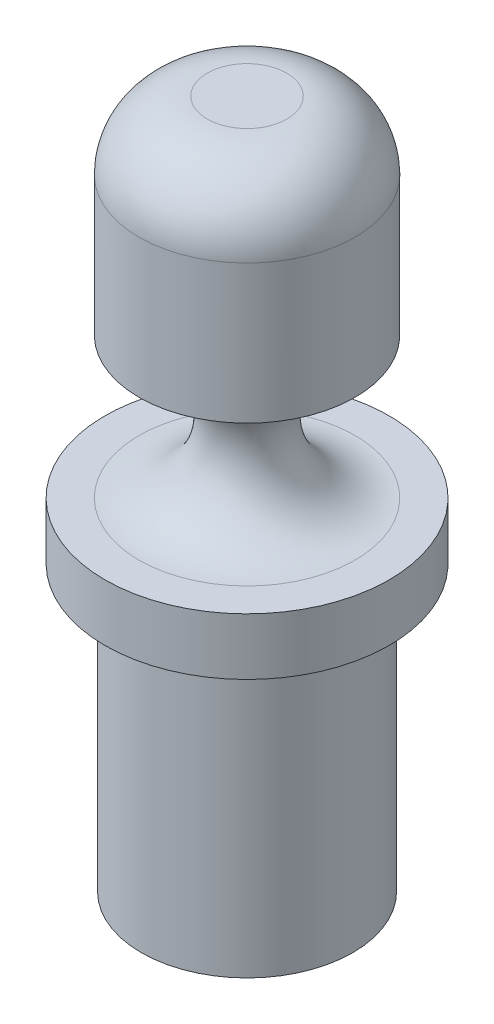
ISO-10303-21;
HEADER;
FILE_DESCRIPTION(('STEP AP214'),'2;1');
FILE_NAME('part.step','',(''),(''),'','','');
FILE_SCHEMA(('AUTOMOTIVE_DESIGN { 1 0 10303 214 1 1 1 1 }'));
ENDSEC;
DATA;
#1=APPLICATION_CONTEXT('core data for automotive mechanical design processes');
#2=APPLICATION_PROTOCOL_DEFINITION('international standard','automotive_design',2000,#1);
#3=PRODUCT_CONTEXT('',#1,'mechanical');
#4=PRODUCT('Part','Part','',(#3));
#5=PRODUCT_RELATED_PRODUCT_CATEGORY('part','',(#4));
#6=PRODUCT_DEFINITION_FORMATION('','',#4);
#7=PRODUCT_DEFINITION_CONTEXT('part definition',#1,'design');
#8=PRODUCT_DEFINITION('design','',#6,#7);
#9=PRODUCT_DEFINITION_SHAPE('','',#8);
#10=(LENGTH_UNIT() NAMED_UNIT(*) SI_UNIT(.MILLI.,.METRE.));
#11=(NAMED_UNIT(*) PLANE_ANGLE_UNIT() SI_UNIT($,.RADIAN.));
#12=(NAMED_UNIT(*) SI_UNIT($,.STERADIAN.) SOLID_ANGLE_UNIT());
#13=UNCERTAINTY_MEASURE_WITH_UNIT(LENGTH_MEASURE(1.E-05),#10,'distance_accuracy_value','');
#14=(GEOMETRIC_REPRESENTATION_CONTEXT(3) GLOBAL_UNCERTAINTY_ASSIGNED_CONTEXT((#13)) GLOBAL_UNIT_ASSIGNED_CONTEXT((#10,
#11,#12)) REPRESENTATION_CONTEXT('',''));
#15=CARTESIAN_POINT('',(0.,0.,0.));
#16=DIRECTION('',(0.,0.,1.));
#17=DIRECTION('',(1.,0.,0.));
#18=AXIS2_PLACEMENT_3D('',#15,#16,#17);
#19=CARTESIAN_POINT('',(0.,13.8684,0.));
#20=DIRECTION('',(0.,-1.,0.));
#21=DIRECTION('',(0.,0.,-1.));
#22=AXIS2_PLACEMENT_3D('',#19,#20,#21);
#23=DEGENERATE_TOROIDAL_SURFACE('',#22,0.888999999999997,1.524,.T.);
#24=CARTESIAN_POINT('',(0.,15.3924,0.));
#25=DIRECTION('',(0.,-1.,0.));
#26=DIRECTION('',(0.,0.,-1.));
#27=AXIS2_PLACEMENT_3D('',#24,#25,#26);
#28=CIRCLE('',#27,0.888999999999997);
#29=CARTESIAN_POINT('',(0.,15.3924,-0.888999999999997));
#30=VERTEX_POINT('',#29);
#31=EDGE_CURVE('E43',#30,#30,#28,.F.);
#32=ORIENTED_EDGE('',*,*,#31,.F.);
#33=EDGE_LOOP('',(#32));
#34=FACE_BOUND('',#33,.T.);
#35=CARTESIAN_POINT('',(0.,13.8684,0.));
#36=DIRECTION('',(0.,-1.,0.));
#37=DIRECTION('',(0.,0.,-1.));
#38=AXIS2_PLACEMENT_3D('',#35,#36,#37);
#39=CIRCLE('',#38,2.413);
#40=CARTESIAN_POINT('',(0.,13.8684,-2.413));
#41=VERTEX_POINT('',#40);
#42=EDGE_CURVE('E10',#41,#41,#39,.T.);
#43=ORIENTED_EDGE('',*,*,#42,.F.);
#44=EDGE_LOOP('',(#43));
#45=FACE_BOUND('',#44,.T.);
#46=ADVANCED_FACE('F37',(#34,#45),#23,.T.);
#47=CARTESIAN_POINT('',(2.413,15.3924,0.));
#48=DIRECTION('',(0.,-1.,0.));
#49=DIRECTION('',(0.,0.,-1.));
#50=AXIS2_PLACEMENT_3D('',#47,#48,#49);
#51=PLANE('',#50);
#52=ORIENTED_EDGE('',*,*,#31,.T.);
#53=EDGE_LOOP('',(#52));
#54=FACE_BOUND('',#53,.T.);
#55=ADVANCED_FACE('F81',(#54),#51,.F.);
#56=CARTESIAN_POINT('',(0.,63.2806748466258,0.));
#57=DIRECTION('',(0.,1.,0.));
#58=DIRECTION('',(0.,0.,1.));
#59=AXIS2_PLACEMENT_3D('',#56,#57,#58);
#60=CYLINDRICAL_SURFACE('',#59,2.413);
#61=ORIENTED_EDGE('',*,*,#42,.T.);
#62=EDGE_LOOP('',(#61));
#63=FACE_BOUND('',#62,.T.);
#64=CARTESIAN_POINT('',(0.,10.7696,0.));
#65=DIRECTION('',(0.,1.,0.));
#66=DIRECTION('',(0.,0.,1.));
#67=AXIS2_PLACEMENT_3D('',#64,#65,#66);
#68=CIRCLE('',#67,2.413);
#69=CARTESIAN_POINT('',(0.,10.7696,2.413));
#70=VERTEX_POINT('',#69);
#71=EDGE_CURVE('E47',#70,#70,#68,.T.);
#72=ORIENTED_EDGE('',*,*,#71,.T.);
#73=EDGE_LOOP('',(#72));
#74=FACE_BOUND('',#73,.T.);
#75=ADVANCED_FACE('F86',(#63,#74),#60,.T.);
#76=CARTESIAN_POINT('',(0.,9.1948,0.));
#77=DIRECTION('',(0.,1.,0.));
#78=DIRECTION('',(0.,0.,1.));
#79=AXIS2_PLACEMENT_3D('',#76,#77,#78);
#80=TOROIDAL_SURFACE('',#79,2.413,1.5748);
#81=ORIENTED_EDGE('',*,*,#71,.F.);
#82=EDGE_LOOP('',(#81));
#83=FACE_BOUND('',#82,.T.);
#84=CARTESIAN_POINT('',(0.,7.62,0.));
#85=DIRECTION('',(0.,1.,0.));
#86=DIRECTION('',(0.,0.,1.));
#87=AXIS2_PLACEMENT_3D('',#84,#85,#86);
#88=CIRCLE('',#87,2.413);
#89=CARTESIAN_POINT('',(0.,7.62,2.413));
#90=VERTEX_POINT('',#89);
#91=EDGE_CURVE('E51',#90,#90,#88,.T.);
#92=ORIENTED_EDGE('',*,*,#91,.T.);
#93=EDGE_LOOP('',(#92));
#94=FACE_BOUND('',#93,.T.);
#95=ADVANCED_FACE('F91',(#83,#94),#80,.F.);
#96=CARTESIAN_POINT('',(3.17500000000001,7.62,0.));
#97=DIRECTION('',(0.,-1.,0.));
#98=DIRECTION('',(0.,0.,-1.));
#99=AXIS2_PLACEMENT_3D('',#96,#97,#98);
#100=PLANE('',#99);
#101=ORIENTED_EDGE('',*,*,#91,.F.);
#102=EDGE_LOOP('',(#101));
#103=FACE_BOUND('',#102,.T.);
#104=CARTESIAN_POINT('',(0.,7.62,0.));
#105=DIRECTION('',(0.,1.,0.));
#106=DIRECTION('',(0.,0.,1.));
#107=AXIS2_PLACEMENT_3D('',#104,#105,#106);
#108=CIRCLE('',#107,3.17500000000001);
#109=CARTESIAN_POINT('',(0.,7.62,3.17500000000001));
#110=VERTEX_POINT('',#109);
#111=EDGE_CURVE('E56',#110,#110,#108,.T.);
#112=ORIENTED_EDGE('',*,*,#111,.T.);
#113=EDGE_LOOP('',(#112));
#114=FACE_BOUND('',#113,.T.);
#115=ADVANCED_FACE('F96',(#103,#114),#100,.F.);
#116=CARTESIAN_POINT('',(0.,63.2806748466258,0.));
#117=DIRECTION('',(0.,1.,0.));
#118=DIRECTION('',(0.,0.,1.));
#119=AXIS2_PLACEMENT_3D('',#116,#117,#118);
#120=CYLINDRICAL_SURFACE('',#119,3.17500000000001);
#121=ORIENTED_EDGE('',*,*,#111,.F.);
#122=EDGE_LOOP('',(#121));
#123=FACE_BOUND('',#122,.T.);
#124=CARTESIAN_POINT('',(0.,6.35,0.));
#125=DIRECTION('',(0.,1.,0.));
#126=DIRECTION('',(0.,0.,1.));
#127=AXIS2_PLACEMENT_3D('',#124,#125,#126);
#128=CIRCLE('',#127,3.17500000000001);
#129=CARTESIAN_POINT('',(0.,6.35,3.17500000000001));
#130=VERTEX_POINT('',#129);
#131=EDGE_CURVE('E59',#130,#130,#128,.T.);
#132=ORIENTED_EDGE('',*,*,#131,.T.);
#133=EDGE_LOOP('',(#132));
#134=FACE_BOUND('',#133,.T.);
#135=ADVANCED_FACE('F100',(#123,#134),#120,.T.);
#136=CARTESIAN_POINT('',(2.3622,6.35,0.));
#137=DIRECTION('',(0.,1.,0.));
#138=DIRECTION('',(0.,0.,1.));
#139=AXIS2_PLACEMENT_3D('',#136,#137,#138);
#140=PLANE('',#139);
#141=ORIENTED_EDGE('',*,*,#131,.F.);
#142=EDGE_LOOP('',(#141));
#143=FACE_BOUND('',#142,.T.);
#144=CARTESIAN_POINT('',(0.,6.35,0.));
#145=DIRECTION('',(0.,1.,0.));
#146=DIRECTION('',(0.,0.,1.));
#147=AXIS2_PLACEMENT_3D('',#144,#145,#146);
#148=CIRCLE('',#147,2.3622);
#149=CARTESIAN_POINT('',(0.,6.35,2.3622));
#150=VERTEX_POINT('',#149);
#151=EDGE_CURVE('E62',#150,#150,#148,.T.);
#152=ORIENTED_EDGE('',*,*,#151,.T.);
#153=EDGE_LOOP('',(#152));
#154=FACE_BOUND('',#153,.T.);
#155=ADVANCED_FACE('F77',(#143,#154),#140,.F.);
#156=CARTESIAN_POINT('',(0.,63.2806748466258,0.));
#157=DIRECTION('',(0.,1.,0.));
#158=DIRECTION('',(0.,0.,1.));
#159=AXIS2_PLACEMENT_3D('',#156,#157,#158);
#160=CYLINDRICAL_SURFACE('',#159,2.3622);
#161=ORIENTED_EDGE('',*,*,#151,.F.);
#162=EDGE_LOOP('',(#161));
#163=FACE_BOUND('',#162,.T.);
#164=CARTESIAN_POINT('',(0.,0.,0.));
#165=DIRECTION('',(0.,1.,0.));
#166=DIRECTION('',(0.,0.,1.));
#167=AXIS2_PLACEMENT_3D('',#164,#165,#166);
#168=CIRCLE('',#167,2.3622);
#169=CARTESIAN_POINT('',(0.,0.,2.3622));
#170=VERTEX_POINT('',#169);
#171=EDGE_CURVE('E65',#170,#170,#168,.T.);
#172=ORIENTED_EDGE('',*,*,#171,.T.);
#173=EDGE_LOOP('',(#172));
#174=FACE_BOUND('',#173,.T.);
#175=ADVANCED_FACE('F69',(#163,#174),#160,.T.);
#176=CARTESIAN_POINT('',(0.,0.,0.));
#177=DIRECTION('',(0.,1.,0.));
#178=DIRECTION('',(0.,0.,1.));
#179=AXIS2_PLACEMENT_3D('',#176,#177,#178);
#180=PLANE('',#179);
#181=ORIENTED_EDGE('',*,*,#171,.F.);
#182=EDGE_LOOP('',(#181));
#183=FACE_BOUND('',#182,.T.);
#184=ADVANCED_FACE('F71',(#183),#180,.F.);
#185=CLOSED_SHELL('',(#46,#55,#75,#95,#115,#135,#155,#175,#184));
#186=MANIFOLD_SOLID_BREP('B2',#185);
#187=ADVANCED_BREP_SHAPE_REPRESENTATION('',(#18,#186),#14);
#188=SHAPE_DEFINITION_REPRESENTATION(#9,#187);
ENDSEC;
END-ISO-10303-21;
